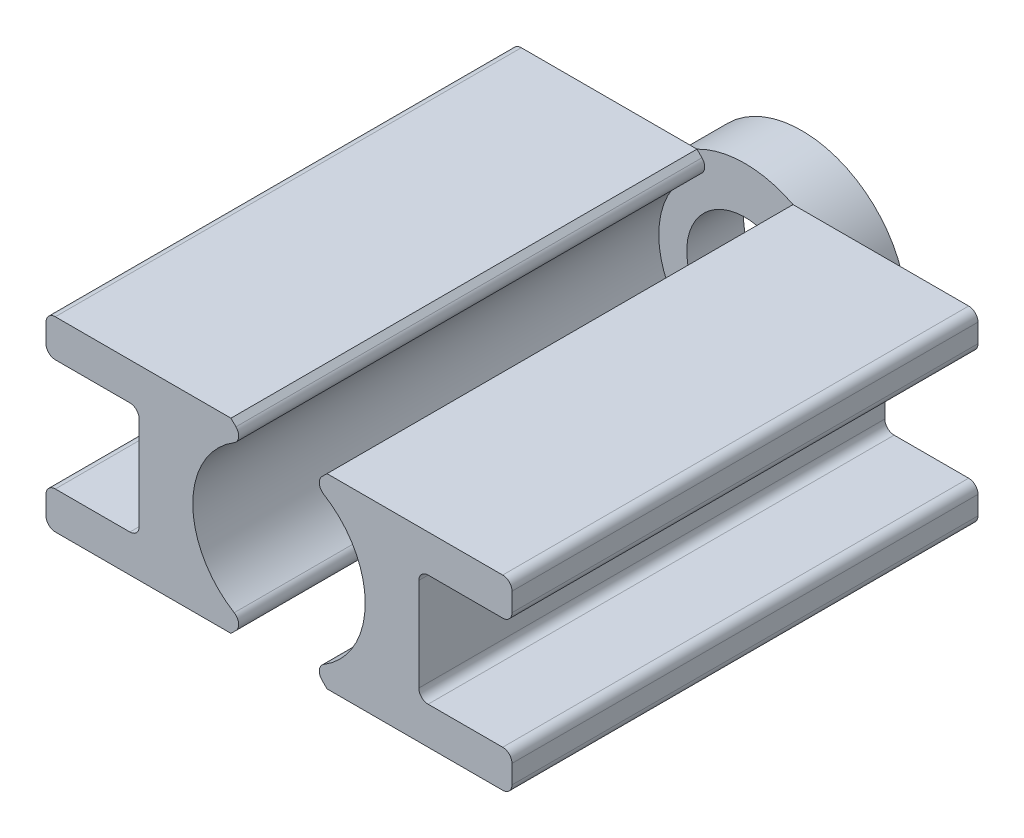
ISO-10303-21;
HEADER;
FILE_DESCRIPTION(('STEP AP214'),'2;1');
FILE_NAME('part.step','',(''),(''),'','','');
FILE_SCHEMA(('AUTOMOTIVE_DESIGN { 1 0 10303 214 1 1 1 1 }'));
ENDSEC;
DATA;
#1=APPLICATION_CONTEXT('core data for automotive mechanical design processes');
#2=APPLICATION_PROTOCOL_DEFINITION('international standard','automotive_design',2000,#1);
#3=PRODUCT_CONTEXT('',#1,'mechanical');
#4=PRODUCT('Part','Part','',(#3));
#5=PRODUCT_RELATED_PRODUCT_CATEGORY('part','',(#4));
#6=PRODUCT_DEFINITION_FORMATION('','',#4);
#7=PRODUCT_DEFINITION_CONTEXT('part definition',#1,'design');
#8=PRODUCT_DEFINITION('design','',#6,#7);
#9=PRODUCT_DEFINITION_SHAPE('','',#8);
#10=(LENGTH_UNIT() NAMED_UNIT(*) SI_UNIT(.MILLI.,.METRE.));
#11=(NAMED_UNIT(*) PLANE_ANGLE_UNIT() SI_UNIT($,.RADIAN.));
#12=(NAMED_UNIT(*) SI_UNIT($,.STERADIAN.) SOLID_ANGLE_UNIT());
#13=UNCERTAINTY_MEASURE_WITH_UNIT(LENGTH_MEASURE(1.E-05),#10,'distance_accuracy_value','');
#14=(GEOMETRIC_REPRESENTATION_CONTEXT(3) GLOBAL_UNCERTAINTY_ASSIGNED_CONTEXT((#13)) GLOBAL_UNIT_ASSIGNED_CONTEXT((#10,
#11,#12)) REPRESENTATION_CONTEXT('',''));
#15=CARTESIAN_POINT('',(0.,0.,0.));
#16=DIRECTION('',(0.,0.,1.));
#17=DIRECTION('',(1.,0.,0.));
#18=AXIS2_PLACEMENT_3D('',#15,#16,#17);
#19=CARTESIAN_POINT('',(0.,0.,12.2));
#20=DIRECTION('',(0.,0.,1.));
#21=DIRECTION('',(1.,0.,0.));
#22=AXIS2_PLACEMENT_3D('',#19,#20,#21);
#23=PLANE('',#22);
#24=CARTESIAN_POINT('',(0.,0.,12.2));
#25=DIRECTION('',(0.,0.,1.));
#26=DIRECTION('',(1.,0.,0.));
#27=AXIS2_PLACEMENT_3D('',#24,#25,#26);
#28=CIRCLE('',#27,22.5);
#29=CARTESIAN_POINT('',(10.307764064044,20.0000000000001,12.2));
#30=VERTEX_POINT('',#29);
#31=CARTESIAN_POINT('',(-10.3077640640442,20.,12.2));
#32=VERTEX_POINT('',#31);
#33=EDGE_CURVE('E11',#30,#32,#28,.T.);
#34=ORIENTED_EDGE('',*,*,#33,.T.);
#35=DIRECTION('',(-0.707106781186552,0.707106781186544,0.));
#36=VECTOR('',#35,1.);
#37=CARTESIAN_POINT('',(-10.3077640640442,20.,12.2));
#38=LINE('',#37,#36);
#39=CARTESIAN_POINT('',(-9.23745516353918,18.929691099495,12.2));
#40=VERTEX_POINT('',#39);
#41=EDGE_CURVE('E295',#40,#32,#38,.T.);
#42=ORIENTED_EDGE('',*,*,#41,.F.);
#43=CARTESIAN_POINT('',(-10.6516687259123,17.5154775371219,12.2));
#44=DIRECTION('',(0.,0.,1.));
#45=DIRECTION('',(1.,0.,0.));
#46=AXIS2_PLACEMENT_3D('',#43,#44,#45);
#47=CIRCLE('',#46,2.);
#48=CARTESIAN_POINT('',(-9.61248153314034,15.8066504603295,12.2));
#49=VERTEX_POINT('',#48);
#50=EDGE_CURVE('E292',#49,#40,#47,.T.);
#51=ORIENTED_EDGE('',*,*,#50,.F.);
#52=CARTESIAN_POINT('',(0.,0.,12.2));
#53=DIRECTION('',(0.,0.,-1.));
#54=DIRECTION('',(1.,0.,0.));
#55=AXIS2_PLACEMENT_3D('',#52,#53,#54);
#56=CIRCLE('',#55,18.5);
#57=CARTESIAN_POINT('',(-9.61248153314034,-15.8066504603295,12.2));
#58=VERTEX_POINT('',#57);
#59=EDGE_CURVE('E60',#58,#49,#56,.T.);
#60=ORIENTED_EDGE('',*,*,#59,.F.);
#61=CARTESIAN_POINT('',(-10.6516687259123,-17.5154775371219,12.2));
#62=DIRECTION('',(0.,0.,1.));
#63=DIRECTION('',(1.,0.,0.));
#64=AXIS2_PLACEMENT_3D('',#61,#62,#63);
#65=CIRCLE('',#64,2.);
#66=CARTESIAN_POINT('',(-9.23745516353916,-18.929691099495,12.2));
#67=VERTEX_POINT('',#66);
#68=EDGE_CURVE('E55',#67,#58,#65,.T.);
#69=ORIENTED_EDGE('',*,*,#68,.F.);
#70=DIRECTION('',(0.707106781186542,0.707106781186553,0.));
#71=VECTOR('',#70,1.);
#72=CARTESIAN_POINT('',(-10.3077640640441,-20.,12.2));
#73=LINE('',#72,#71);
#74=CARTESIAN_POINT('',(-10.3077640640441,-20.,12.2));
#75=VERTEX_POINT('',#74);
#76=EDGE_CURVE('E508',#75,#67,#73,.T.);
#77=ORIENTED_EDGE('',*,*,#76,.F.);
#78=CARTESIAN_POINT('',(10.3077640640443,-19.9999999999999,12.2));
#79=VERTEX_POINT('',#78);
#80=EDGE_CURVE('E47',#75,#79,#28,.T.);
#81=ORIENTED_EDGE('',*,*,#80,.T.);
#82=DIRECTION('',(0.70710678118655,-0.707106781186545,0.));
#83=VECTOR('',#82,1.);
#84=CARTESIAN_POINT('',(10.3077640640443,-19.9999999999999,12.2));
#85=LINE('',#84,#83);
#86=CARTESIAN_POINT('',(9.23745516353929,-18.9296910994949,12.2));
#87=VERTEX_POINT('',#86);
#88=EDGE_CURVE('E358',#87,#79,#85,.T.);
#89=ORIENTED_EDGE('',*,*,#88,.F.);
#90=CARTESIAN_POINT('',(10.6516687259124,-17.5154775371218,12.2));
#91=DIRECTION('',(0.,0.,1.));
#92=DIRECTION('',(1.,0.,0.));
#93=AXIS2_PLACEMENT_3D('',#90,#91,#92);
#94=CIRCLE('',#93,2.);
#95=CARTESIAN_POINT('',(9.61248153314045,-15.8066504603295,12.2));
#96=VERTEX_POINT('',#95);
#97=EDGE_CURVE('E355',#96,#87,#94,.T.);
#98=ORIENTED_EDGE('',*,*,#97,.F.);
#99=CARTESIAN_POINT('',(0.,0.,12.2));
#100=DIRECTION('',(0.,0.,-1.));
#101=DIRECTION('',(1.,0.,0.));
#102=AXIS2_PLACEMENT_3D('',#99,#100,#101);
#103=CIRCLE('',#102,18.5);
#104=CARTESIAN_POINT('',(9.61248153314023,15.8066504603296,12.2));
#105=VERTEX_POINT('',#104);
#106=EDGE_CURVE('E352',#105,#96,#103,.T.);
#107=ORIENTED_EDGE('',*,*,#106,.F.);
#108=CARTESIAN_POINT('',(10.6516687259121,17.515477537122,12.2));
#109=DIRECTION('',(0.,0.,1.));
#110=DIRECTION('',(1.,0.,0.));
#111=AXIS2_PLACEMENT_3D('',#108,#109,#110);
#112=CIRCLE('',#111,2.);
#113=CARTESIAN_POINT('',(9.23745516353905,18.9296910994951,12.2));
#114=VERTEX_POINT('',#113);
#115=EDGE_CURVE('E349',#114,#105,#112,.T.);
#116=ORIENTED_EDGE('',*,*,#115,.F.);
#117=DIRECTION('',(-0.707106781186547,-0.707106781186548,0.));
#118=VECTOR('',#117,1.);
#119=CARTESIAN_POINT('',(10.307764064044,20.0000000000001,12.2));
#120=LINE('',#119,#118);
#121=EDGE_CURVE('E346',#30,#114,#120,.T.);
#122=ORIENTED_EDGE('',*,*,#121,.F.);
#123=EDGE_LOOP('',(#34,#42,#51,#60,#69,#77,#81,#89,#98,#107,#116,#122));
#124=FACE_BOUND('',#123,.T.);
#125=CARTESIAN_POINT('',(0.,0.,12.2));
#126=DIRECTION('',(0.,0.,1.));
#127=DIRECTION('',(1.,0.,0.));
#128=AXIS2_PLACEMENT_3D('',#125,#126,#127);
#129=CIRCLE('',#128,12.5);
#130=CARTESIAN_POINT('',(12.5,0.,12.2));
#131=VERTEX_POINT('',#130);
#132=EDGE_CURVE('E436',#131,#131,#129,.T.);
#133=ORIENTED_EDGE('',*,*,#132,.F.);
#134=EDGE_LOOP('',(#133));
#135=FACE_BOUND('',#134,.T.);
#136=ADVANCED_FACE('F37',(#124,#135),#23,.T.);
#137=CARTESIAN_POINT('',(0.,0.,0.));
#138=DIRECTION('',(0.,0.,1.));
#139=DIRECTION('',(1.,0.,0.));
#140=AXIS2_PLACEMENT_3D('',#137,#138,#139);
#141=PLANE('',#140);
#142=CARTESIAN_POINT('',(0.,0.,0.));
#143=DIRECTION('',(0.,0.,1.));
#144=DIRECTION('',(1.,0.,0.));
#145=AXIS2_PLACEMENT_3D('',#142,#143,#144);
#146=CIRCLE('',#145,22.5);
#147=CARTESIAN_POINT('',(22.5,0.,0.));
#148=VERTEX_POINT('',#147);
#149=EDGE_CURVE('E41',#148,#148,#146,.T.);
#150=ORIENTED_EDGE('',*,*,#149,.F.);
#151=EDGE_LOOP('',(#150));
#152=FACE_BOUND('',#151,.T.);
#153=CARTESIAN_POINT('',(0.,0.,0.));
#154=DIRECTION('',(0.,0.,1.));
#155=DIRECTION('',(1.,0.,0.));
#156=AXIS2_PLACEMENT_3D('',#153,#154,#155);
#157=CIRCLE('',#156,12.5);
#158=CARTESIAN_POINT('',(12.5,0.,0.));
#159=VERTEX_POINT('',#158);
#160=EDGE_CURVE('E435',#159,#159,#157,.T.);
#161=ORIENTED_EDGE('',*,*,#160,.T.);
#162=EDGE_LOOP('',(#161));
#163=FACE_BOUND('',#162,.T.);
#164=ADVANCED_FACE('F442',(#152,#163),#141,.F.);
#165=CARTESIAN_POINT('',(0.,0.,12.2));
#166=DIRECTION('',(0.,0.,-1.));
#167=DIRECTION('',(-1.,0.,0.));
#168=AXIS2_PLACEMENT_3D('',#165,#166,#167);
#169=CYLINDRICAL_SURFACE('',#168,22.5);
#170=ORIENTED_EDGE('',*,*,#33,.F.);
#171=EDGE_CURVE('E48',#79,#30,#28,.T.);
#172=ORIENTED_EDGE('',*,*,#171,.F.);
#173=ORIENTED_EDGE('',*,*,#80,.F.);
#174=EDGE_CURVE('E46',#32,#75,#28,.T.);
#175=ORIENTED_EDGE('',*,*,#174,.F.);
#176=EDGE_LOOP('',(#170,#172,#173,#175));
#177=FACE_BOUND('',#176,.T.);
#178=ORIENTED_EDGE('',*,*,#149,.T.);
#179=EDGE_LOOP('',(#178));
#180=FACE_BOUND('',#179,.T.);
#181=ADVANCED_FACE('F39',(#177,#180),#169,.T.);
#182=CARTESIAN_POINT('',(0.,0.,12.2));
#183=DIRECTION('',(0.,0.,-1.));
#184=DIRECTION('',(-1.,0.,0.));
#185=AXIS2_PLACEMENT_3D('',#182,#183,#184);
#186=CYLINDRICAL_SURFACE('',#185,12.5);
#187=ORIENTED_EDGE('',*,*,#132,.T.);
#188=EDGE_LOOP('',(#187));
#189=FACE_BOUND('',#188,.T.);
#190=ORIENTED_EDGE('',*,*,#160,.F.);
#191=EDGE_LOOP('',(#190));
#192=FACE_BOUND('',#191,.T.);
#193=ADVANCED_FACE('F444',(#189,#192),#186,.F.);
#194=CARTESIAN_POINT('',(47.9999999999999,18.0000000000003,12.2));
#195=DIRECTION('',(0.,0.,1.));
#196=DIRECTION('',(1.,0.,0.));
#197=AXIS2_PLACEMENT_3D('',#194,#195,#196);
#198=PLANE('',#197);
#199=DIRECTION('',(1.,0.,0.));
#200=VECTOR('',#199,1.);
#201=CARTESIAN_POINT('',(48.0000000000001,-19.9999999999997,12.2));
#202=LINE('',#201,#200);
#203=CARTESIAN_POINT('',(48.0000000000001,-19.9999999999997,12.2));
#204=VERTEX_POINT('',#203);
#205=EDGE_CURVE('E361',#79,#204,#202,.T.);
#206=ORIENTED_EDGE('',*,*,#205,.F.);
#207=ORIENTED_EDGE('',*,*,#171,.T.);
#208=DIRECTION('',(-1.,0.,0.));
#209=VECTOR('',#208,1.);
#210=CARTESIAN_POINT('',(47.9999999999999,20.0000000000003,12.2));
#211=LINE('',#210,#209);
#212=CARTESIAN_POINT('',(47.9999999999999,20.0000000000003,12.2));
#213=VERTEX_POINT('',#212);
#214=EDGE_CURVE('E299',#213,#30,#211,.T.);
#215=ORIENTED_EDGE('',*,*,#214,.F.);
#216=CARTESIAN_POINT('',(47.9999999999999,18.0000000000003,12.2));
#217=DIRECTION('',(0.,0.,1.));
#218=DIRECTION('',(1.,0.,0.));
#219=AXIS2_PLACEMENT_3D('',#216,#217,#218);
#220=CIRCLE('',#219,2.);
#221=CARTESIAN_POINT('',(49.9999999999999,18.0000000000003,12.2));
#222=VERTEX_POINT('',#221);
#223=EDGE_CURVE('E296',#222,#213,#220,.T.);
#224=ORIENTED_EDGE('',*,*,#223,.F.);
#225=DIRECTION('',(0.,1.,0.));
#226=VECTOR('',#225,1.);
#227=CARTESIAN_POINT('',(49.9999999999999,18.0000000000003,12.2));
#228=LINE('',#227,#226);
#229=CARTESIAN_POINT('',(49.9999999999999,14.0000000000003,12.2));
#230=VERTEX_POINT('',#229);
#231=EDGE_CURVE('E309',#230,#222,#228,.T.);
#232=ORIENTED_EDGE('',*,*,#231,.F.);
#233=CARTESIAN_POINT('',(47.9999999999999,14.0000000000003,12.2));
#234=DIRECTION('',(0.,0.,1.));
#235=DIRECTION('',(-1.,0.,0.));
#236=AXIS2_PLACEMENT_3D('',#233,#234,#235);
#237=CIRCLE('',#236,2.);
#238=CARTESIAN_POINT('',(47.9999999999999,12.0000000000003,12.2));
#239=VERTEX_POINT('',#238);
#240=EDGE_CURVE('E379',#239,#230,#237,.T.);
#241=ORIENTED_EDGE('',*,*,#240,.F.);
#242=DIRECTION('',(1.,0.,0.));
#243=VECTOR('',#242,1.);
#244=CARTESIAN_POINT('',(47.9999999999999,12.0000000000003,12.2));
#245=LINE('',#244,#243);
#246=CARTESIAN_POINT('',(31.9999999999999,12.0000000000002,12.2));
#247=VERTEX_POINT('',#246);
#248=EDGE_CURVE('E377',#247,#239,#245,.T.);
#249=ORIENTED_EDGE('',*,*,#248,.F.);
#250=CARTESIAN_POINT('',(31.9999999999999,10.0000000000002,12.2));
#251=DIRECTION('',(0.,0.,-1.));
#252=DIRECTION('',(1.,0.,0.));
#253=AXIS2_PLACEMENT_3D('',#250,#251,#252);
#254=CIRCLE('',#253,2.);
#255=CARTESIAN_POINT('',(29.9999999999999,10.0000000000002,12.2));
#256=VERTEX_POINT('',#255);
#257=EDGE_CURVE('E375',#256,#247,#254,.T.);
#258=ORIENTED_EDGE('',*,*,#257,.F.);
#259=DIRECTION('',(0.,1.,0.));
#260=VECTOR('',#259,1.);
#261=CARTESIAN_POINT('',(29.9999999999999,10.0000000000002,12.2));
#262=LINE('',#261,#260);
#263=CARTESIAN_POINT('',(30.0000000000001,-9.99999999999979,12.2));
#264=VERTEX_POINT('',#263);
#265=EDGE_CURVE('E373',#264,#256,#262,.T.);
#266=ORIENTED_EDGE('',*,*,#265,.F.);
#267=CARTESIAN_POINT('',(32.0000000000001,-9.99999999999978,12.2));
#268=DIRECTION('',(0.,0.,-1.));
#269=DIRECTION('',(1.,0.,0.));
#270=AXIS2_PLACEMENT_3D('',#267,#268,#269);
#271=CIRCLE('',#270,2.);
#272=CARTESIAN_POINT('',(32.0000000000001,-11.9999999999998,12.2));
#273=VERTEX_POINT('',#272);
#274=EDGE_CURVE('E371',#273,#264,#271,.T.);
#275=ORIENTED_EDGE('',*,*,#274,.F.);
#276=DIRECTION('',(-1.,0.,0.));
#277=VECTOR('',#276,1.);
#278=CARTESIAN_POINT('',(48.0000000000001,-11.9999999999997,12.2));
#279=LINE('',#278,#277);
#280=CARTESIAN_POINT('',(48.0000000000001,-11.9999999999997,12.2));
#281=VERTEX_POINT('',#280);
#282=EDGE_CURVE('E369',#281,#273,#279,.T.);
#283=ORIENTED_EDGE('',*,*,#282,.F.);
#284=CARTESIAN_POINT('',(48.0000000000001,-13.9999999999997,12.2));
#285=DIRECTION('',(0.,0.,1.));
#286=DIRECTION('',(1.,0.,0.));
#287=AXIS2_PLACEMENT_3D('',#284,#285,#286);
#288=CIRCLE('',#287,2.);
#289=CARTESIAN_POINT('',(50.0000000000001,-13.9999999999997,12.2));
#290=VERTEX_POINT('',#289);
#291=EDGE_CURVE('E367',#290,#281,#288,.T.);
#292=ORIENTED_EDGE('',*,*,#291,.F.);
#293=DIRECTION('',(0.,1.,0.));
#294=VECTOR('',#293,1.);
#295=CARTESIAN_POINT('',(50.0000000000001,-13.9999999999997,12.2));
#296=LINE('',#295,#294);
#297=CARTESIAN_POINT('',(50.0000000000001,-17.9999999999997,12.2));
#298=VERTEX_POINT('',#297);
#299=EDGE_CURVE('E365',#298,#290,#296,.T.);
#300=ORIENTED_EDGE('',*,*,#299,.F.);
#301=CARTESIAN_POINT('',(48.0000000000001,-17.9999999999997,12.2));
#302=DIRECTION('',(0.,0.,1.));
#303=DIRECTION('',(-1.,0.,0.));
#304=AXIS2_PLACEMENT_3D('',#301,#302,#303);
#305=CIRCLE('',#304,2.);
#306=EDGE_CURVE('E363',#204,#298,#305,.T.);
#307=ORIENTED_EDGE('',*,*,#306,.F.);
#308=EDGE_LOOP('',(#206,#207,#215,#224,#232,#241,#249,#258,#266,#275,#283,#292,#300,#307));
#309=FACE_BOUND('',#308,.T.);
#310=ADVANCED_FACE('F446',(#309),#198,.F.);
#311=CARTESIAN_POINT('',(47.9999999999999,18.0000000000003,112.2));
#312=DIRECTION('',(0.,0.,-1.));
#313=DIRECTION('',(-1.,0.,0.));
#314=AXIS2_PLACEMENT_3D('',#311,#312,#313);
#315=CYLINDRICAL_SURFACE('',#314,2.);
#316=ORIENTED_EDGE('',*,*,#223,.T.);
#317=DIRECTION('',(0.,0.,-1.));
#318=VECTOR('',#317,1.);
#319=CARTESIAN_POINT('',(47.9999999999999,20.0000000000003,112.2));
#320=LINE('',#319,#318);
#321=CARTESIAN_POINT('',(47.9999999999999,20.0000000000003,112.2));
#322=VERTEX_POINT('',#321);
#323=EDGE_CURVE('E432',#322,#213,#320,.T.);
#324=ORIENTED_EDGE('',*,*,#323,.F.);
#325=CARTESIAN_POINT('',(47.9999999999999,18.0000000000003,112.2));
#326=DIRECTION('',(0.,0.,1.));
#327=DIRECTION('',(1.,0.,0.));
#328=AXIS2_PLACEMENT_3D('',#325,#326,#327);
#329=CIRCLE('',#328,2.);
#330=CARTESIAN_POINT('',(49.9999999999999,18.0000000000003,112.2));
#331=VERTEX_POINT('',#330);
#332=EDGE_CURVE('E305',#331,#322,#329,.T.);
#333=ORIENTED_EDGE('',*,*,#332,.F.);
#334=DIRECTION('',(0.,0.,-1.));
#335=VECTOR('',#334,1.);
#336=CARTESIAN_POINT('',(49.9999999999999,18.0000000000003,112.2));
#337=LINE('',#336,#335);
#338=EDGE_CURVE('E342',#331,#222,#337,.T.);
#339=ORIENTED_EDGE('',*,*,#338,.T.);
#340=EDGE_LOOP('',(#316,#324,#333,#339));
#341=FACE_BOUND('',#340,.T.);
#342=ADVANCED_FACE('F453',(#341),#315,.T.);
#343=CARTESIAN_POINT('',(47.9999999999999,20.0000000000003,112.2));
#344=DIRECTION('',(0.,-1.,0.));
#345=DIRECTION('',(1.,0.,0.));
#346=AXIS2_PLACEMENT_3D('',#343,#344,#345);
#347=PLANE('',#346);
#348=ORIENTED_EDGE('',*,*,#214,.T.);
#349=DIRECTION('',(0.,0.,-1.));
#350=VECTOR('',#349,1.);
#351=CARTESIAN_POINT('',(10.307764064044,20.0000000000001,112.2));
#352=LINE('',#351,#350);
#353=CARTESIAN_POINT('',(10.307764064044,20.0000000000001,112.2));
#354=VERTEX_POINT('',#353);
#355=EDGE_CURVE('E429',#354,#30,#352,.T.);
#356=ORIENTED_EDGE('',*,*,#355,.F.);
#357=DIRECTION('',(-1.,0.,0.));
#358=VECTOR('',#357,1.);
#359=CARTESIAN_POINT('',(47.9999999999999,20.0000000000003,112.2));
#360=LINE('',#359,#358);
#361=EDGE_CURVE('E308',#322,#354,#360,.T.);
#362=ORIENTED_EDGE('',*,*,#361,.F.);
#363=ORIENTED_EDGE('',*,*,#323,.T.);
#364=EDGE_LOOP('',(#348,#356,#362,#363));
#365=FACE_BOUND('',#364,.T.);
#366=ADVANCED_FACE('F741',(#365),#347,.F.);
#367=CARTESIAN_POINT('',(10.307764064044,20.0000000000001,112.2));
#368=DIRECTION('',(0.707106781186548,-0.707106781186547,0.));
#369=DIRECTION('',(0.707106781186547,0.707106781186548,0.));
#370=AXIS2_PLACEMENT_3D('',#367,#368,#369);
#371=PLANE('',#370);
#372=ORIENTED_EDGE('',*,*,#121,.T.);
#373=DIRECTION('',(0.,0.,-1.));
#374=VECTOR('',#373,1.);
#375=CARTESIAN_POINT('',(9.23745516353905,18.9296910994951,112.2));
#376=LINE('',#375,#374);
#377=CARTESIAN_POINT('',(9.23745516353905,18.9296910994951,112.2));
#378=VERTEX_POINT('',#377);
#379=EDGE_CURVE('E426',#378,#114,#376,.T.);
#380=ORIENTED_EDGE('',*,*,#379,.F.);
#381=DIRECTION('',(-0.707106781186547,-0.707106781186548,0.));
#382=VECTOR('',#381,1.);
#383=CARTESIAN_POINT('',(10.307764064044,20.0000000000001,112.2));
#384=LINE('',#383,#382);
#385=EDGE_CURVE('E311',#354,#378,#384,.T.);
#386=ORIENTED_EDGE('',*,*,#385,.F.);
#387=ORIENTED_EDGE('',*,*,#355,.T.);
#388=EDGE_LOOP('',(#372,#380,#386,#387));
#389=FACE_BOUND('',#388,.T.);
#390=ADVANCED_FACE('F737',(#389),#371,.F.);
#391=CARTESIAN_POINT('',(10.6516687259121,17.515477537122,112.2));
#392=DIRECTION('',(0.,0.,-1.));
#393=DIRECTION('',(-1.,0.,0.));
#394=AXIS2_PLACEMENT_3D('',#391,#392,#393);
#395=CYLINDRICAL_SURFACE('',#394,2.);
#396=ORIENTED_EDGE('',*,*,#115,.T.);
#397=DIRECTION('',(0.,0.,-1.));
#398=VECTOR('',#397,1.);
#399=CARTESIAN_POINT('',(9.61248153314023,15.8066504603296,112.2));
#400=LINE('',#399,#398);
#401=CARTESIAN_POINT('',(9.61248153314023,15.8066504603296,112.2));
#402=VERTEX_POINT('',#401);
#403=EDGE_CURVE('E423',#402,#105,#400,.T.);
#404=ORIENTED_EDGE('',*,*,#403,.F.);
#405=CARTESIAN_POINT('',(10.6516687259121,17.515477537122,112.2));
#406=DIRECTION('',(0.,0.,1.));
#407=DIRECTION('',(1.,0.,0.));
#408=AXIS2_PLACEMENT_3D('',#405,#406,#407);
#409=CIRCLE('',#408,2.);
#410=EDGE_CURVE('E313',#378,#402,#409,.T.);
#411=ORIENTED_EDGE('',*,*,#410,.F.);
#412=ORIENTED_EDGE('',*,*,#379,.T.);
#413=EDGE_LOOP('',(#396,#404,#411,#412));
#414=FACE_BOUND('',#413,.T.);
#415=ADVANCED_FACE('F733',(#414),#395,.T.);
#416=CARTESIAN_POINT('',(0.,0.,112.2));
#417=DIRECTION('',(0.,0.,-1.));
#418=DIRECTION('',(-1.,0.,0.));
#419=AXIS2_PLACEMENT_3D('',#416,#417,#418);
#420=CYLINDRICAL_SURFACE('',#419,18.5);
#421=ORIENTED_EDGE('',*,*,#106,.T.);
#422=DIRECTION('',(0.,0.,-1.));
#423=VECTOR('',#422,1.);
#424=CARTESIAN_POINT('',(9.61248153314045,-15.8066504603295,112.2));
#425=LINE('',#424,#423);
#426=CARTESIAN_POINT('',(9.61248153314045,-15.8066504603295,112.2));
#427=VERTEX_POINT('',#426);
#428=EDGE_CURVE('E420',#427,#96,#425,.T.);
#429=ORIENTED_EDGE('',*,*,#428,.F.);
#430=CARTESIAN_POINT('',(0.,0.,112.2));
#431=DIRECTION('',(0.,0.,-1.));
#432=DIRECTION('',(1.,0.,0.));
#433=AXIS2_PLACEMENT_3D('',#430,#431,#432);
#434=CIRCLE('',#433,18.5);
#435=EDGE_CURVE('E315',#402,#427,#434,.T.);
#436=ORIENTED_EDGE('',*,*,#435,.F.);
#437=ORIENTED_EDGE('',*,*,#403,.T.);
#438=EDGE_LOOP('',(#421,#429,#436,#437));
#439=FACE_BOUND('',#438,.T.);
#440=ADVANCED_FACE('F729',(#439),#420,.F.);
#441=CARTESIAN_POINT('',(10.6516687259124,-17.5154775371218,112.2));
#442=DIRECTION('',(0.,0.,-1.));
#443=DIRECTION('',(-1.,0.,0.));
#444=AXIS2_PLACEMENT_3D('',#441,#442,#443);
#445=CYLINDRICAL_SURFACE('',#444,2.);
#446=ORIENTED_EDGE('',*,*,#97,.T.);
#447=DIRECTION('',(0.,0.,-1.));
#448=VECTOR('',#447,1.);
#449=CARTESIAN_POINT('',(9.23745516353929,-18.9296910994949,112.2));
#450=LINE('',#449,#448);
#451=CARTESIAN_POINT('',(9.23745516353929,-18.9296910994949,112.2));
#452=VERTEX_POINT('',#451);
#453=EDGE_CURVE('E417',#452,#87,#450,.T.);
#454=ORIENTED_EDGE('',*,*,#453,.F.);
#455=CARTESIAN_POINT('',(10.6516687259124,-17.5154775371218,112.2));
#456=DIRECTION('',(0.,0.,1.));
#457=DIRECTION('',(1.,0.,0.));
#458=AXIS2_PLACEMENT_3D('',#455,#456,#457);
#459=CIRCLE('',#458,2.);
#460=EDGE_CURVE('E317',#427,#452,#459,.T.);
#461=ORIENTED_EDGE('',*,*,#460,.F.);
#462=ORIENTED_EDGE('',*,*,#428,.T.);
#463=EDGE_LOOP('',(#446,#454,#461,#462));
#464=FACE_BOUND('',#463,.T.);
#465=ADVANCED_FACE('F725',(#464),#445,.T.);
#466=CARTESIAN_POINT('',(10.3077640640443,-19.9999999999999,112.2));
#467=DIRECTION('',(0.707106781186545,0.70710678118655,0.));
#468=DIRECTION('',(-0.70710678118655,0.707106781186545,0.));
#469=AXIS2_PLACEMENT_3D('',#466,#467,#468);
#470=PLANE('',#469);
#471=ORIENTED_EDGE('',*,*,#88,.T.);
#472=DIRECTION('',(0.,0.,-1.));
#473=VECTOR('',#472,1.);
#474=CARTESIAN_POINT('',(10.3077640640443,-19.9999999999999,112.2));
#475=LINE('',#474,#473);
#476=CARTESIAN_POINT('',(10.3077640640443,-19.9999999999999,112.2));
#477=VERTEX_POINT('',#476);
#478=EDGE_CURVE('E414',#477,#79,#475,.T.);
#479=ORIENTED_EDGE('',*,*,#478,.F.);
#480=DIRECTION('',(0.70710678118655,-0.707106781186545,0.));
#481=VECTOR('',#480,1.);
#482=CARTESIAN_POINT('',(10.3077640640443,-19.9999999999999,112.2));
#483=LINE('',#482,#481);
#484=EDGE_CURVE('E319',#452,#477,#483,.T.);
#485=ORIENTED_EDGE('',*,*,#484,.F.);
#486=ORIENTED_EDGE('',*,*,#453,.T.);
#487=EDGE_LOOP('',(#471,#479,#485,#486));
#488=FACE_BOUND('',#487,.T.);
#489=ADVANCED_FACE('F721',(#488),#470,.F.);
#490=CARTESIAN_POINT('',(48.0000000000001,-19.9999999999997,112.2));
#491=DIRECTION('',(0.,1.,0.));
#492=DIRECTION('',(-1.,0.,0.));
#493=AXIS2_PLACEMENT_3D('',#490,#491,#492);
#494=PLANE('',#493);
#495=ORIENTED_EDGE('',*,*,#205,.T.);
#496=DIRECTION('',(0.,0.,-1.));
#497=VECTOR('',#496,1.);
#498=CARTESIAN_POINT('',(48.0000000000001,-19.9999999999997,112.2));
#499=LINE('',#498,#497);
#500=CARTESIAN_POINT('',(48.0000000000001,-19.9999999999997,112.2));
#501=VERTEX_POINT('',#500);
#502=EDGE_CURVE('E411',#501,#204,#499,.T.);
#503=ORIENTED_EDGE('',*,*,#502,.F.);
#504=DIRECTION('',(1.,0.,0.));
#505=VECTOR('',#504,1.);
#506=CARTESIAN_POINT('',(48.0000000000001,-19.9999999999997,112.2));
#507=LINE('',#506,#505);
#508=EDGE_CURVE('E321',#477,#501,#507,.T.);
#509=ORIENTED_EDGE('',*,*,#508,.F.);
#510=ORIENTED_EDGE('',*,*,#478,.T.);
#511=EDGE_LOOP('',(#495,#503,#509,#510));
#512=FACE_BOUND('',#511,.T.);
#513=ADVANCED_FACE('F717',(#512),#494,.F.);
#514=CARTESIAN_POINT('',(48.0000000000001,-17.9999999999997,112.2));
#515=DIRECTION('',(0.,0.,-1.));
#516=DIRECTION('',(-1.,0.,0.));
#517=AXIS2_PLACEMENT_3D('',#514,#515,#516);
#518=CYLINDRICAL_SURFACE('',#517,2.);
#519=ORIENTED_EDGE('',*,*,#306,.T.);
#520=DIRECTION('',(0.,0.,-1.));
#521=VECTOR('',#520,1.);
#522=CARTESIAN_POINT('',(50.0000000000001,-17.9999999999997,112.2));
#523=LINE('',#522,#521);
#524=CARTESIAN_POINT('',(50.0000000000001,-17.9999999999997,112.2));
#525=VERTEX_POINT('',#524);
#526=EDGE_CURVE('E408',#525,#298,#523,.T.);
#527=ORIENTED_EDGE('',*,*,#526,.F.);
#528=CARTESIAN_POINT('',(48.0000000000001,-17.9999999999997,112.2));
#529=DIRECTION('',(0.,0.,1.));
#530=DIRECTION('',(-1.,0.,0.));
#531=AXIS2_PLACEMENT_3D('',#528,#529,#530);
#532=CIRCLE('',#531,2.);
#533=EDGE_CURVE('E323',#501,#525,#532,.T.);
#534=ORIENTED_EDGE('',*,*,#533,.F.);
#535=ORIENTED_EDGE('',*,*,#502,.T.);
#536=EDGE_LOOP('',(#519,#527,#534,#535));
#537=FACE_BOUND('',#536,.T.);
#538=ADVANCED_FACE('F713',(#537),#518,.T.);
#539=CARTESIAN_POINT('',(50.0000000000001,-13.9999999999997,112.2));
#540=DIRECTION('',(-1.,0.,0.));
#541=DIRECTION('',(0.,-1.,0.));
#542=AXIS2_PLACEMENT_3D('',#539,#540,#541);
#543=PLANE('',#542);
#544=ORIENTED_EDGE('',*,*,#299,.T.);
#545=DIRECTION('',(0.,0.,-1.));
#546=VECTOR('',#545,1.);
#547=CARTESIAN_POINT('',(50.0000000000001,-13.9999999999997,112.2));
#548=LINE('',#547,#546);
#549=CARTESIAN_POINT('',(50.0000000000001,-13.9999999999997,112.2));
#550=VERTEX_POINT('',#549);
#551=EDGE_CURVE('E405',#550,#290,#548,.T.);
#552=ORIENTED_EDGE('',*,*,#551,.F.);
#553=DIRECTION('',(0.,1.,0.));
#554=VECTOR('',#553,1.);
#555=CARTESIAN_POINT('',(50.0000000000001,-13.9999999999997,112.2));
#556=LINE('',#555,#554);
#557=EDGE_CURVE('E325',#525,#550,#556,.T.);
#558=ORIENTED_EDGE('',*,*,#557,.F.);
#559=ORIENTED_EDGE('',*,*,#526,.T.);
#560=EDGE_LOOP('',(#544,#552,#558,#559));
#561=FACE_BOUND('',#560,.T.);
#562=ADVANCED_FACE('F709',(#561),#543,.F.);
#563=CARTESIAN_POINT('',(48.0000000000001,-13.9999999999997,112.2));
#564=DIRECTION('',(0.,0.,-1.));
#565=DIRECTION('',(-1.,0.,0.));
#566=AXIS2_PLACEMENT_3D('',#563,#564,#565);
#567=CYLINDRICAL_SURFACE('',#566,2.);
#568=ORIENTED_EDGE('',*,*,#291,.T.);
#569=DIRECTION('',(0.,0.,-1.));
#570=VECTOR('',#569,1.);
#571=CARTESIAN_POINT('',(48.0000000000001,-11.9999999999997,112.2));
#572=LINE('',#571,#570);
#573=CARTESIAN_POINT('',(48.0000000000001,-11.9999999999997,112.2));
#574=VERTEX_POINT('',#573);
#575=EDGE_CURVE('E402',#574,#281,#572,.T.);
#576=ORIENTED_EDGE('',*,*,#575,.F.);
#577=CARTESIAN_POINT('',(48.0000000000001,-13.9999999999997,112.2));
#578=DIRECTION('',(0.,0.,1.));
#579=DIRECTION('',(1.,0.,0.));
#580=AXIS2_PLACEMENT_3D('',#577,#578,#579);
#581=CIRCLE('',#580,2.);
#582=EDGE_CURVE('E327',#550,#574,#581,.T.);
#583=ORIENTED_EDGE('',*,*,#582,.F.);
#584=ORIENTED_EDGE('',*,*,#551,.T.);
#585=EDGE_LOOP('',(#568,#576,#583,#584));
#586=FACE_BOUND('',#585,.T.);
#587=ADVANCED_FACE('F705',(#586),#567,.T.);
#588=CARTESIAN_POINT('',(48.0000000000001,-11.9999999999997,112.2));
#589=DIRECTION('',(0.,-1.,0.));
#590=DIRECTION('',(1.,0.,0.));
#591=AXIS2_PLACEMENT_3D('',#588,#589,#590);
#592=PLANE('',#591);
#593=ORIENTED_EDGE('',*,*,#282,.T.);
#594=DIRECTION('',(0.,0.,-1.));
#595=VECTOR('',#594,1.);
#596=CARTESIAN_POINT('',(32.0000000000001,-11.9999999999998,112.2));
#597=LINE('',#596,#595);
#598=CARTESIAN_POINT('',(32.0000000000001,-11.9999999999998,112.2));
#599=VERTEX_POINT('',#598);
#600=EDGE_CURVE('E399',#599,#273,#597,.T.);
#601=ORIENTED_EDGE('',*,*,#600,.F.);
#602=DIRECTION('',(-1.,0.,0.));
#603=VECTOR('',#602,1.);
#604=CARTESIAN_POINT('',(48.0000000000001,-11.9999999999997,112.2));
#605=LINE('',#604,#603);
#606=EDGE_CURVE('E329',#574,#599,#605,.T.);
#607=ORIENTED_EDGE('',*,*,#606,.F.);
#608=ORIENTED_EDGE('',*,*,#575,.T.);
#609=EDGE_LOOP('',(#593,#601,#607,#608));
#610=FACE_BOUND('',#609,.T.);
#611=ADVANCED_FACE('F701',(#610),#592,.F.);
#612=CARTESIAN_POINT('',(32.0000000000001,-9.99999999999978,112.2));
#613=DIRECTION('',(0.,0.,-1.));
#614=DIRECTION('',(-1.,0.,0.));
#615=AXIS2_PLACEMENT_3D('',#612,#613,#614);
#616=CYLINDRICAL_SURFACE('',#615,2.);
#617=ORIENTED_EDGE('',*,*,#274,.T.);
#618=DIRECTION('',(0.,0.,-1.));
#619=VECTOR('',#618,1.);
#620=CARTESIAN_POINT('',(30.0000000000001,-9.99999999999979,112.2));
#621=LINE('',#620,#619);
#622=CARTESIAN_POINT('',(30.0000000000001,-9.99999999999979,112.2));
#623=VERTEX_POINT('',#622);
#624=EDGE_CURVE('E396',#623,#264,#621,.T.);
#625=ORIENTED_EDGE('',*,*,#624,.F.);
#626=CARTESIAN_POINT('',(32.0000000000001,-9.99999999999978,112.2));
#627=DIRECTION('',(0.,0.,-1.));
#628=DIRECTION('',(1.,0.,0.));
#629=AXIS2_PLACEMENT_3D('',#626,#627,#628);
#630=CIRCLE('',#629,2.);
#631=EDGE_CURVE('E331',#599,#623,#630,.T.);
#632=ORIENTED_EDGE('',*,*,#631,.F.);
#633=ORIENTED_EDGE('',*,*,#600,.T.);
#634=EDGE_LOOP('',(#617,#625,#632,#633));
#635=FACE_BOUND('',#634,.T.);
#636=ADVANCED_FACE('F697',(#635),#616,.F.);
#637=CARTESIAN_POINT('',(29.9999999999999,10.0000000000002,112.2));
#638=DIRECTION('',(-1.,0.,0.));
#639=DIRECTION('',(0.,-1.,0.));
#640=AXIS2_PLACEMENT_3D('',#637,#638,#639);
#641=PLANE('',#640);
#642=ORIENTED_EDGE('',*,*,#265,.T.);
#643=DIRECTION('',(0.,0.,-1.));
#644=VECTOR('',#643,1.);
#645=CARTESIAN_POINT('',(29.9999999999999,10.0000000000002,112.2));
#646=LINE('',#645,#644);
#647=CARTESIAN_POINT('',(29.9999999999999,10.0000000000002,112.2));
#648=VERTEX_POINT('',#647);
#649=EDGE_CURVE('E393',#648,#256,#646,.T.);
#650=ORIENTED_EDGE('',*,*,#649,.F.);
#651=DIRECTION('',(0.,1.,0.));
#652=VECTOR('',#651,1.);
#653=CARTESIAN_POINT('',(29.9999999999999,10.0000000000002,112.2));
#654=LINE('',#653,#652);
#655=EDGE_CURVE('E333',#623,#648,#654,.T.);
#656=ORIENTED_EDGE('',*,*,#655,.F.);
#657=ORIENTED_EDGE('',*,*,#624,.T.);
#658=EDGE_LOOP('',(#642,#650,#656,#657));
#659=FACE_BOUND('',#658,.T.);
#660=ADVANCED_FACE('F693',(#659),#641,.F.);
#661=CARTESIAN_POINT('',(31.9999999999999,10.0000000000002,112.2));
#662=DIRECTION('',(0.,0.,-1.));
#663=DIRECTION('',(-1.,0.,0.));
#664=AXIS2_PLACEMENT_3D('',#661,#662,#663);
#665=CYLINDRICAL_SURFACE('',#664,2.);
#666=ORIENTED_EDGE('',*,*,#257,.T.);
#667=DIRECTION('',(0.,0.,-1.));
#668=VECTOR('',#667,1.);
#669=CARTESIAN_POINT('',(31.9999999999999,12.0000000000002,112.2));
#670=LINE('',#669,#668);
#671=CARTESIAN_POINT('',(31.9999999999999,12.0000000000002,112.2));
#672=VERTEX_POINT('',#671);
#673=EDGE_CURVE('E390',#672,#247,#670,.T.);
#674=ORIENTED_EDGE('',*,*,#673,.F.);
#675=CARTESIAN_POINT('',(31.9999999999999,10.0000000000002,112.2));
#676=DIRECTION('',(0.,0.,-1.));
#677=DIRECTION('',(1.,0.,0.));
#678=AXIS2_PLACEMENT_3D('',#675,#676,#677);
#679=CIRCLE('',#678,2.);
#680=EDGE_CURVE('E335',#648,#672,#679,.T.);
#681=ORIENTED_EDGE('',*,*,#680,.F.);
#682=ORIENTED_EDGE('',*,*,#649,.T.);
#683=EDGE_LOOP('',(#666,#674,#681,#682));
#684=FACE_BOUND('',#683,.T.);
#685=ADVANCED_FACE('F689',(#684),#665,.F.);
#686=CARTESIAN_POINT('',(47.9999999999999,12.0000000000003,112.2));
#687=DIRECTION('',(0.,1.,0.));
#688=DIRECTION('',(-1.,0.,0.));
#689=AXIS2_PLACEMENT_3D('',#686,#687,#688);
#690=PLANE('',#689);
#691=ORIENTED_EDGE('',*,*,#248,.T.);
#692=DIRECTION('',(0.,0.,-1.));
#693=VECTOR('',#692,1.);
#694=CARTESIAN_POINT('',(47.9999999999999,12.0000000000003,112.2));
#695=LINE('',#694,#693);
#696=CARTESIAN_POINT('',(47.9999999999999,12.0000000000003,112.2));
#697=VERTEX_POINT('',#696);
#698=EDGE_CURVE('E387',#697,#239,#695,.T.);
#699=ORIENTED_EDGE('',*,*,#698,.F.);
#700=DIRECTION('',(1.,0.,0.));
#701=VECTOR('',#700,1.);
#702=CARTESIAN_POINT('',(47.9999999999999,12.0000000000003,112.2));
#703=LINE('',#702,#701);
#704=EDGE_CURVE('E337',#672,#697,#703,.T.);
#705=ORIENTED_EDGE('',*,*,#704,.F.);
#706=ORIENTED_EDGE('',*,*,#673,.T.);
#707=EDGE_LOOP('',(#691,#699,#705,#706));
#708=FACE_BOUND('',#707,.T.);
#709=ADVANCED_FACE('F685',(#708),#690,.F.);
#710=CARTESIAN_POINT('',(47.9999999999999,14.0000000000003,112.2));
#711=DIRECTION('',(0.,0.,-1.));
#712=DIRECTION('',(-1.,0.,0.));
#713=AXIS2_PLACEMENT_3D('',#710,#711,#712);
#714=CYLINDRICAL_SURFACE('',#713,2.);
#715=ORIENTED_EDGE('',*,*,#240,.T.);
#716=DIRECTION('',(0.,0.,-1.));
#717=VECTOR('',#716,1.);
#718=CARTESIAN_POINT('',(49.9999999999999,14.0000000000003,112.2));
#719=LINE('',#718,#717);
#720=CARTESIAN_POINT('',(49.9999999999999,14.0000000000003,112.2));
#721=VERTEX_POINT('',#720);
#722=EDGE_CURVE('E384',#721,#230,#719,.T.);
#723=ORIENTED_EDGE('',*,*,#722,.F.);
#724=CARTESIAN_POINT('',(47.9999999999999,14.0000000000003,112.2));
#725=DIRECTION('',(0.,0.,1.));
#726=DIRECTION('',(-1.,0.,0.));
#727=AXIS2_PLACEMENT_3D('',#724,#725,#726);
#728=CIRCLE('',#727,2.);
#729=EDGE_CURVE('E339',#697,#721,#728,.T.);
#730=ORIENTED_EDGE('',*,*,#729,.F.);
#731=ORIENTED_EDGE('',*,*,#698,.T.);
#732=EDGE_LOOP('',(#715,#723,#730,#731));
#733=FACE_BOUND('',#732,.T.);
#734=ADVANCED_FACE('F681',(#733),#714,.T.);
#735=CARTESIAN_POINT('',(49.9999999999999,18.0000000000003,112.2));
#736=DIRECTION('',(-1.,0.,0.));
#737=DIRECTION('',(0.,-1.,0.));
#738=AXIS2_PLACEMENT_3D('',#735,#736,#737);
#739=PLANE('',#738);
#740=ORIENTED_EDGE('',*,*,#231,.T.);
#741=ORIENTED_EDGE('',*,*,#338,.F.);
#742=DIRECTION('',(0.,1.,0.));
#743=VECTOR('',#742,1.);
#744=CARTESIAN_POINT('',(49.9999999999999,18.0000000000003,112.2));
#745=LINE('',#744,#743);
#746=EDGE_CURVE('E341',#721,#331,#745,.T.);
#747=ORIENTED_EDGE('',*,*,#746,.F.);
#748=ORIENTED_EDGE('',*,*,#722,.T.);
#749=EDGE_LOOP('',(#740,#741,#747,#748));
#750=FACE_BOUND('',#749,.T.);
#751=ADVANCED_FACE('F676',(#750),#739,.F.);
#752=CARTESIAN_POINT('',(47.9999999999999,18.0000000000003,112.2));
#753=DIRECTION('',(0.,0.,1.));
#754=DIRECTION('',(1.,0.,0.));
#755=AXIS2_PLACEMENT_3D('',#752,#753,#754);
#756=PLANE('',#755);
#757=ORIENTED_EDGE('',*,*,#332,.T.);
#758=ORIENTED_EDGE('',*,*,#361,.T.);
#759=ORIENTED_EDGE('',*,*,#385,.T.);
#760=ORIENTED_EDGE('',*,*,#410,.T.);
#761=ORIENTED_EDGE('',*,*,#435,.T.);
#762=ORIENTED_EDGE('',*,*,#460,.T.);
#763=ORIENTED_EDGE('',*,*,#484,.T.);
#764=ORIENTED_EDGE('',*,*,#508,.T.);
#765=ORIENTED_EDGE('',*,*,#533,.T.);
#766=ORIENTED_EDGE('',*,*,#557,.T.);
#767=ORIENTED_EDGE('',*,*,#582,.T.);
#768=ORIENTED_EDGE('',*,*,#606,.T.);
#769=ORIENTED_EDGE('',*,*,#631,.T.);
#770=ORIENTED_EDGE('',*,*,#655,.T.);
#771=ORIENTED_EDGE('',*,*,#680,.T.);
#772=ORIENTED_EDGE('',*,*,#704,.T.);
#773=ORIENTED_EDGE('',*,*,#729,.T.);
#774=ORIENTED_EDGE('',*,*,#746,.T.);
#775=EDGE_LOOP('',(#757,#758,#759,#760,#761,#762,#763,#764,#765,#766,#767,#768,#769,#770,#771,
#772,#773,#774));
#776=FACE_BOUND('',#775,.T.);
#777=ADVANCED_FACE('F674',(#776),#756,.T.);
#778=CARTESIAN_POINT('',(-10.3077640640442,20.,112.2));
#779=DIRECTION('',(-0.707106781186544,-0.707106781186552,0.));
#780=DIRECTION('',(0.707106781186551,-0.707106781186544,0.));
#781=AXIS2_PLACEMENT_3D('',#778,#779,#780);
#782=PLANE('',#781);
#783=ORIENTED_EDGE('',*,*,#41,.T.);
#784=DIRECTION('',(0.,0.,-1.));
#785=VECTOR('',#784,1.);
#786=CARTESIAN_POINT('',(-10.3077640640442,20.,112.2));
#787=LINE('',#786,#785);
#788=CARTESIAN_POINT('',(-10.3077640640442,20.,112.2));
#789=VERTEX_POINT('',#788);
#790=EDGE_CURVE('E276',#789,#32,#787,.T.);
#791=ORIENTED_EDGE('',*,*,#790,.F.);
#792=DIRECTION('',(-0.707106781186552,0.707106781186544,0.));
#793=VECTOR('',#792,1.);
#794=CARTESIAN_POINT('',(-10.3077640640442,20.,112.2));
#795=LINE('',#794,#793);
#796=CARTESIAN_POINT('',(-9.23745516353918,18.929691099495,112.2));
#797=VERTEX_POINT('',#796);
#798=EDGE_CURVE('E283',#797,#789,#795,.T.);
#799=ORIENTED_EDGE('',*,*,#798,.F.);
#800=DIRECTION('',(0.,0.,-1.));
#801=VECTOR('',#800,1.);
#802=CARTESIAN_POINT('',(-9.23745516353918,18.929691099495,112.2));
#803=LINE('',#802,#801);
#804=EDGE_CURVE('E513',#797,#40,#803,.T.);
#805=ORIENTED_EDGE('',*,*,#804,.T.);
#806=EDGE_LOOP('',(#783,#791,#799,#805));
#807=FACE_BOUND('',#806,.T.);
#808=ADVANCED_FACE('F294',(#807),#782,.F.);
#809=CARTESIAN_POINT('',(-48.,20.,112.2));
#810=DIRECTION('',(0.,-1.,0.));
#811=DIRECTION('',(0.,0.,-1.));
#812=AXIS2_PLACEMENT_3D('',#809,#810,#811);
#813=PLANE('',#812);
#814=DIRECTION('',(-1.,0.,0.));
#815=VECTOR('',#814,1.);
#816=CARTESIAN_POINT('',(-48.,20.,12.2));
#817=LINE('',#816,#815);
#818=CARTESIAN_POINT('',(-48.,20.,12.2));
#819=VERTEX_POINT('',#818);
#820=EDGE_CURVE('E475',#32,#819,#817,.T.);
#821=ORIENTED_EDGE('',*,*,#820,.T.);
#822=DIRECTION('',(0.,0.,-1.));
#823=VECTOR('',#822,1.);
#824=CARTESIAN_POINT('',(-48.,20.,112.2));
#825=LINE('',#824,#823);
#826=CARTESIAN_POINT('',(-48.,20.,112.2));
#827=VERTEX_POINT('',#826);
#828=EDGE_CURVE('E279',#827,#819,#825,.T.);
#829=ORIENTED_EDGE('',*,*,#828,.F.);
#830=DIRECTION('',(-1.,0.,0.));
#831=VECTOR('',#830,1.);
#832=CARTESIAN_POINT('',(-48.,20.,112.2));
#833=LINE('',#832,#831);
#834=EDGE_CURVE('E272',#789,#827,#833,.T.);
#835=ORIENTED_EDGE('',*,*,#834,.F.);
#836=ORIENTED_EDGE('',*,*,#790,.T.);
#837=EDGE_LOOP('',(#821,#829,#835,#836));
#838=FACE_BOUND('',#837,.T.);
#839=ADVANCED_FACE('F274',(#838),#813,.F.);
#840=CARTESIAN_POINT('',(-48.,18.,112.2));
#841=DIRECTION('',(0.,0.,-1.));
#842=DIRECTION('',(-1.,0.,0.));
#843=AXIS2_PLACEMENT_3D('',#840,#841,#842);
#844=CYLINDRICAL_SURFACE('',#843,2.);
#845=CARTESIAN_POINT('',(-48.,18.,12.2));
#846=DIRECTION('',(0.,0.,1.));
#847=DIRECTION('',(-1.,0.,0.));
#848=AXIS2_PLACEMENT_3D('',#845,#846,#847);
#849=CIRCLE('',#848,2.);
#850=CARTESIAN_POINT('',(-50.,18.,12.2));
#851=VERTEX_POINT('',#850);
#852=EDGE_CURVE('E480',#819,#851,#849,.T.);
#853=ORIENTED_EDGE('',*,*,#852,.T.);
#854=DIRECTION('',(0.,0.,-1.));
#855=VECTOR('',#854,1.);
#856=CARTESIAN_POINT('',(-50.,18.,112.2));
#857=LINE('',#856,#855);
#858=CARTESIAN_POINT('',(-50.,18.,112.2));
#859=VERTEX_POINT('',#858);
#860=EDGE_CURVE('E301',#859,#851,#857,.T.);
#861=ORIENTED_EDGE('',*,*,#860,.F.);
#862=CARTESIAN_POINT('',(-48.,18.,112.2));
#863=DIRECTION('',(0.,0.,1.));
#864=DIRECTION('',(-1.,0.,0.));
#865=AXIS2_PLACEMENT_3D('',#862,#863,#864);
#866=CIRCLE('',#865,2.);
#867=EDGE_CURVE('E282',#827,#859,#866,.T.);
#868=ORIENTED_EDGE('',*,*,#867,.F.);
#869=ORIENTED_EDGE('',*,*,#828,.T.);
#870=EDGE_LOOP('',(#853,#861,#868,#869));
#871=FACE_BOUND('',#870,.T.);
#872=ADVANCED_FACE('F667',(#871),#844,.T.);
#873=CARTESIAN_POINT('',(-50.,18.,112.2));
#874=DIRECTION('',(1.,0.,0.));
#875=DIRECTION('',(0.,1.,0.));
#876=AXIS2_PLACEMENT_3D('',#873,#874,#875);
#877=PLANE('',#876);
#878=DIRECTION('',(0.,-1.,0.));
#879=VECTOR('',#878,1.);
#880=CARTESIAN_POINT('',(-50.,18.,12.2));
#881=LINE('',#880,#879);
#882=CARTESIAN_POINT('',(-50.,14.,12.2));
#883=VERTEX_POINT('',#882);
#884=EDGE_CURVE('E482',#851,#883,#881,.T.);
#885=ORIENTED_EDGE('',*,*,#884,.T.);
#886=DIRECTION('',(0.,0.,-1.));
#887=VECTOR('',#886,1.);
#888=CARTESIAN_POINT('',(-50.,14.,112.2));
#889=LINE('',#888,#887);
#890=CARTESIAN_POINT('',(-50.,14.,112.2));
#891=VERTEX_POINT('',#890);
#892=EDGE_CURVE('E554',#891,#883,#889,.T.);
#893=ORIENTED_EDGE('',*,*,#892,.F.);
#894=DIRECTION('',(0.,-1.,0.));
#895=VECTOR('',#894,1.);
#896=CARTESIAN_POINT('',(-50.,18.,112.2));
#897=LINE('',#896,#895);
#898=EDGE_CURVE('E562',#859,#891,#897,.T.);
#899=ORIENTED_EDGE('',*,*,#898,.F.);
#900=ORIENTED_EDGE('',*,*,#860,.T.);
#901=EDGE_LOOP('',(#885,#893,#899,#900));
#902=FACE_BOUND('',#901,.T.);
#903=ADVANCED_FACE('F560',(#902),#877,.F.);
#904=CARTESIAN_POINT('',(-48.,14.,112.2));
#905=DIRECTION('',(0.,0.,-1.));
#906=DIRECTION('',(-1.,0.,0.));
#907=AXIS2_PLACEMENT_3D('',#904,#905,#906);
#908=CYLINDRICAL_SURFACE('',#907,2.);
#909=CARTESIAN_POINT('',(-48.,14.,12.2));
#910=DIRECTION('',(0.,0.,1.));
#911=DIRECTION('',(1.,0.,0.));
#912=AXIS2_PLACEMENT_3D('',#909,#910,#911);
#913=CIRCLE('',#912,2.);
#914=CARTESIAN_POINT('',(-48.,12.,12.2));
#915=VERTEX_POINT('',#914);
#916=EDGE_CURVE('E488',#883,#915,#913,.T.);
#917=ORIENTED_EDGE('',*,*,#916,.T.);
#918=DIRECTION('',(0.,0.,-1.));
#919=VECTOR('',#918,1.);
#920=CARTESIAN_POINT('',(-48.,12.,112.2));
#921=LINE('',#920,#919);
#922=CARTESIAN_POINT('',(-48.,12.,112.2));
#923=VERTEX_POINT('',#922);
#924=EDGE_CURVE('E551',#923,#915,#921,.T.);
#925=ORIENTED_EDGE('',*,*,#924,.F.);
#926=CARTESIAN_POINT('',(-48.,14.,112.2));
#927=DIRECTION('',(0.,0.,1.));
#928=DIRECTION('',(1.,0.,0.));
#929=AXIS2_PLACEMENT_3D('',#926,#927,#928);
#930=CIRCLE('',#929,2.);
#931=EDGE_CURVE('E578',#891,#923,#930,.T.);
#932=ORIENTED_EDGE('',*,*,#931,.F.);
#933=ORIENTED_EDGE('',*,*,#892,.T.);
#934=EDGE_LOOP('',(#917,#925,#932,#933));
#935=FACE_BOUND('',#934,.T.);
#936=ADVANCED_FACE('F569',(#935),#908,.T.);
#937=CARTESIAN_POINT('',(-48.,12.,112.2));
#938=DIRECTION('',(0.,1.,0.));
#939=DIRECTION('',(0.,0.,1.));
#940=AXIS2_PLACEMENT_3D('',#937,#938,#939);
#941=PLANE('',#940);
#942=DIRECTION('',(1.,0.,0.));
#943=VECTOR('',#942,1.);
#944=CARTESIAN_POINT('',(-48.,12.,12.2));
#945=LINE('',#944,#943);
#946=CARTESIAN_POINT('',(-32.,12.,12.2));
#947=VERTEX_POINT('',#946);
#948=EDGE_CURVE('E490',#915,#947,#945,.T.);
#949=ORIENTED_EDGE('',*,*,#948,.T.);
#950=DIRECTION('',(0.,0.,-1.));
#951=VECTOR('',#950,1.);
#952=CARTESIAN_POINT('',(-32.,12.,112.2));
#953=LINE('',#952,#951);
#954=CARTESIAN_POINT('',(-32.,12.,112.2));
#955=VERTEX_POINT('',#954);
#956=EDGE_CURVE('E548',#955,#947,#953,.T.);
#957=ORIENTED_EDGE('',*,*,#956,.F.);
#958=DIRECTION('',(1.,0.,0.));
#959=VECTOR('',#958,1.);
#960=CARTESIAN_POINT('',(-48.,12.,112.2));
#961=LINE('',#960,#959);
#962=EDGE_CURVE('E575',#923,#955,#961,.T.);
#963=ORIENTED_EDGE('',*,*,#962,.F.);
#964=ORIENTED_EDGE('',*,*,#924,.T.);
#965=EDGE_LOOP('',(#949,#957,#963,#964));
#966=FACE_BOUND('',#965,.T.);
#967=ADVANCED_FACE('F573',(#966),#941,.F.);
#968=CARTESIAN_POINT('',(-32.,10.,112.2));
#969=DIRECTION('',(0.,0.,-1.));
#970=DIRECTION('',(-1.,0.,0.));
#971=AXIS2_PLACEMENT_3D('',#968,#969,#970);
#972=CYLINDRICAL_SURFACE('',#971,2.);
#973=CARTESIAN_POINT('',(-32.,10.,12.2));
#974=DIRECTION('',(0.,0.,-1.));
#975=DIRECTION('',(-1.,0.,0.));
#976=AXIS2_PLACEMENT_3D('',#973,#974,#975);
#977=CIRCLE('',#976,2.);
#978=CARTESIAN_POINT('',(-30.,9.99999999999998,12.2));
#979=VERTEX_POINT('',#978);
#980=EDGE_CURVE('E492',#947,#979,#977,.T.);
#981=ORIENTED_EDGE('',*,*,#980,.T.);
#982=DIRECTION('',(0.,0.,-1.));
#983=VECTOR('',#982,1.);
#984=CARTESIAN_POINT('',(-30.,9.99999999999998,112.2));
#985=LINE('',#984,#983);
#986=CARTESIAN_POINT('',(-30.,9.99999999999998,112.2));
#987=VERTEX_POINT('',#986);
#988=EDGE_CURVE('E545',#987,#979,#985,.T.);
#989=ORIENTED_EDGE('',*,*,#988,.F.);
#990=CARTESIAN_POINT('',(-32.,10.,112.2));
#991=DIRECTION('',(0.,0.,-1.));
#992=DIRECTION('',(-1.,0.,0.));
#993=AXIS2_PLACEMENT_3D('',#990,#991,#992);
#994=CIRCLE('',#993,2.);
#995=EDGE_CURVE('E577',#955,#987,#994,.T.);
#996=ORIENTED_EDGE('',*,*,#995,.F.);
#997=ORIENTED_EDGE('',*,*,#956,.T.);
#998=EDGE_LOOP('',(#981,#989,#996,#997));
#999=FACE_BOUND('',#998,.T.);
#1000=ADVANCED_FACE('F656',(#999),#972,.F.);
#1001=CARTESIAN_POINT('',(-30.,9.99999999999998,112.2));
#1002=DIRECTION('',(1.,0.,0.));
#1003=DIRECTION('',(0.,1.,0.));
#1004=AXIS2_PLACEMENT_3D('',#1001,#1002,#1003);
#1005=PLANE('',#1004);
#1006=DIRECTION('',(0.,-1.,0.));
#1007=VECTOR('',#1006,1.);
#1008=CARTESIAN_POINT('',(-30.,9.99999999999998,12.2));
#1009=LINE('',#1008,#1007);
#1010=CARTESIAN_POINT('',(-30.,-9.99999999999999,12.2));
#1011=VERTEX_POINT('',#1010);
#1012=EDGE_CURVE('E494',#979,#1011,#1009,.T.);
#1013=ORIENTED_EDGE('',*,*,#1012,.T.);
#1014=DIRECTION('',(0.,0.,-1.));
#1015=VECTOR('',#1014,1.);
#1016=CARTESIAN_POINT('',(-30.,-9.99999999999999,112.2));
#1017=LINE('',#1016,#1015);
#1018=CARTESIAN_POINT('',(-30.,-9.99999999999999,112.2));
#1019=VERTEX_POINT('',#1018);
#1020=EDGE_CURVE('E542',#1019,#1011,#1017,.T.);
#1021=ORIENTED_EDGE('',*,*,#1020,.F.);
#1022=DIRECTION('',(0.,-1.,0.));
#1023=VECTOR('',#1022,1.);
#1024=CARTESIAN_POINT('',(-30.,9.99999999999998,112.2));
#1025=LINE('',#1024,#1023);
#1026=EDGE_CURVE('E580',#987,#1019,#1025,.T.);
#1027=ORIENTED_EDGE('',*,*,#1026,.F.);
#1028=ORIENTED_EDGE('',*,*,#988,.T.);
#1029=EDGE_LOOP('',(#1013,#1021,#1027,#1028));
#1030=FACE_BOUND('',#1029,.T.);
#1031=ADVANCED_FACE('F652',(#1030),#1005,.F.);
#1032=CARTESIAN_POINT('',(-32.,-10.,112.2));
#1033=DIRECTION('',(0.,0.,-1.));
#1034=DIRECTION('',(-1.,0.,0.));
#1035=AXIS2_PLACEMENT_3D('',#1032,#1033,#1034);
#1036=CYLINDRICAL_SURFACE('',#1035,2.);
#1037=CARTESIAN_POINT('',(-32.,-10.,12.2));
#1038=DIRECTION('',(0.,0.,-1.));
#1039=DIRECTION('',(-1.,0.,0.));
#1040=AXIS2_PLACEMENT_3D('',#1037,#1038,#1039);
#1041=CIRCLE('',#1040,2.);
#1042=CARTESIAN_POINT('',(-32.,-12.,12.2));
#1043=VERTEX_POINT('',#1042);
#1044=EDGE_CURVE('E496',#1011,#1043,#1041,.T.);
#1045=ORIENTED_EDGE('',*,*,#1044,.T.);
#1046=DIRECTION('',(0.,0.,-1.));
#1047=VECTOR('',#1046,1.);
#1048=CARTESIAN_POINT('',(-32.,-12.,112.2));
#1049=LINE('',#1048,#1047);
#1050=CARTESIAN_POINT('',(-32.,-12.,112.2));
#1051=VERTEX_POINT('',#1050);
#1052=EDGE_CURVE('E539',#1051,#1043,#1049,.T.);
#1053=ORIENTED_EDGE('',*,*,#1052,.F.);
#1054=CARTESIAN_POINT('',(-32.,-10.,112.2));
#1055=DIRECTION('',(0.,0.,-1.));
#1056=DIRECTION('',(-1.,0.,0.));
#1057=AXIS2_PLACEMENT_3D('',#1054,#1055,#1056);
#1058=CIRCLE('',#1057,2.);
#1059=EDGE_CURVE('E586',#1019,#1051,#1058,.T.);
#1060=ORIENTED_EDGE('',*,*,#1059,.F.);
#1061=ORIENTED_EDGE('',*,*,#1020,.T.);
#1062=EDGE_LOOP('',(#1045,#1053,#1060,#1061));
#1063=FACE_BOUND('',#1062,.T.);
#1064=ADVANCED_FACE('F648',(#1063),#1036,.F.);
#1065=CARTESIAN_POINT('',(-48.,-12.,112.2));
#1066=DIRECTION('',(0.,-1.,0.));
#1067=DIRECTION('',(0.,0.,-1.));
#1068=AXIS2_PLACEMENT_3D('',#1065,#1066,#1067);
#1069=PLANE('',#1068);
#1070=DIRECTION('',(-1.,0.,0.));
#1071=VECTOR('',#1070,1.);
#1072=CARTESIAN_POINT('',(-48.,-12.,12.2));
#1073=LINE('',#1072,#1071);
#1074=CARTESIAN_POINT('',(-48.,-12.,12.2));
#1075=VERTEX_POINT('',#1074);
#1076=EDGE_CURVE('E498',#1043,#1075,#1073,.T.);
#1077=ORIENTED_EDGE('',*,*,#1076,.T.);
#1078=DIRECTION('',(0.,0.,-1.));
#1079=VECTOR('',#1078,1.);
#1080=CARTESIAN_POINT('',(-48.,-12.,112.2));
#1081=LINE('',#1080,#1079);
#1082=CARTESIAN_POINT('',(-48.,-12.,112.2));
#1083=VERTEX_POINT('',#1082);
#1084=EDGE_CURVE('E536',#1083,#1075,#1081,.T.);
#1085=ORIENTED_EDGE('',*,*,#1084,.F.);
#1086=DIRECTION('',(-1.,0.,0.));
#1087=VECTOR('',#1086,1.);
#1088=CARTESIAN_POINT('',(-48.,-12.,112.2));
#1089=LINE('',#1088,#1087);
#1090=EDGE_CURVE('E588',#1051,#1083,#1089,.T.);
#1091=ORIENTED_EDGE('',*,*,#1090,.F.);
#1092=ORIENTED_EDGE('',*,*,#1052,.T.);
#1093=EDGE_LOOP('',(#1077,#1085,#1091,#1092));
#1094=FACE_BOUND('',#1093,.T.);
#1095=ADVANCED_FACE('F644',(#1094),#1069,.F.);
#1096=CARTESIAN_POINT('',(-48.,-14.,112.2));
#1097=DIRECTION('',(0.,0.,-1.));
#1098=DIRECTION('',(-1.,0.,0.));
#1099=AXIS2_PLACEMENT_3D('',#1096,#1097,#1098);
#1100=CYLINDRICAL_SURFACE('',#1099,2.);
#1101=CARTESIAN_POINT('',(-48.,-14.,12.2));
#1102=DIRECTION('',(0.,0.,1.));
#1103=DIRECTION('',(-1.,0.,0.));
#1104=AXIS2_PLACEMENT_3D('',#1101,#1102,#1103);
#1105=CIRCLE('',#1104,2.);
#1106=CARTESIAN_POINT('',(-50.,-14.,12.2));
#1107=VERTEX_POINT('',#1106);
#1108=EDGE_CURVE('E500',#1075,#1107,#1105,.T.);
#1109=ORIENTED_EDGE('',*,*,#1108,.T.);
#1110=DIRECTION('',(0.,0.,-1.));
#1111=VECTOR('',#1110,1.);
#1112=CARTESIAN_POINT('',(-50.,-14.,112.2));
#1113=LINE('',#1112,#1111);
#1114=CARTESIAN_POINT('',(-50.,-14.,112.2));
#1115=VERTEX_POINT('',#1114);
#1116=EDGE_CURVE('E533',#1115,#1107,#1113,.T.);
#1117=ORIENTED_EDGE('',*,*,#1116,.F.);
#1118=CARTESIAN_POINT('',(-48.,-14.,112.2));
#1119=DIRECTION('',(0.,0.,1.));
#1120=DIRECTION('',(-1.,0.,0.));
#1121=AXIS2_PLACEMENT_3D('',#1118,#1119,#1120);
#1122=CIRCLE('',#1121,2.);
#1123=EDGE_CURVE('E590',#1083,#1115,#1122,.T.);
#1124=ORIENTED_EDGE('',*,*,#1123,.F.);
#1125=ORIENTED_EDGE('',*,*,#1084,.T.);
#1126=EDGE_LOOP('',(#1109,#1117,#1124,#1125));
#1127=FACE_BOUND('',#1126,.T.);
#1128=ADVANCED_FACE('F640',(#1127),#1100,.T.);
#1129=CARTESIAN_POINT('',(-50.,-14.,112.2));
#1130=DIRECTION('',(1.,0.,0.));
#1131=DIRECTION('',(0.,1.,0.));
#1132=AXIS2_PLACEMENT_3D('',#1129,#1130,#1131);
#1133=PLANE('',#1132);
#1134=DIRECTION('',(0.,-1.,0.));
#1135=VECTOR('',#1134,1.);
#1136=CARTESIAN_POINT('',(-50.,-14.,12.2));
#1137=LINE('',#1136,#1135);
#1138=CARTESIAN_POINT('',(-50.,-18.,12.2));
#1139=VERTEX_POINT('',#1138);
#1140=EDGE_CURVE('E502',#1107,#1139,#1137,.T.);
#1141=ORIENTED_EDGE('',*,*,#1140,.T.);
#1142=DIRECTION('',(0.,0.,-1.));
#1143=VECTOR('',#1142,1.);
#1144=CARTESIAN_POINT('',(-50.,-18.,112.2));
#1145=LINE('',#1144,#1143);
#1146=CARTESIAN_POINT('',(-50.,-18.,112.2));
#1147=VERTEX_POINT('',#1146);
#1148=EDGE_CURVE('E530',#1147,#1139,#1145,.T.);
#1149=ORIENTED_EDGE('',*,*,#1148,.F.);
#1150=DIRECTION('',(0.,-1.,0.));
#1151=VECTOR('',#1150,1.);
#1152=CARTESIAN_POINT('',(-50.,-14.,112.2));
#1153=LINE('',#1152,#1151);
#1154=EDGE_CURVE('E592',#1115,#1147,#1153,.T.);
#1155=ORIENTED_EDGE('',*,*,#1154,.F.);
#1156=ORIENTED_EDGE('',*,*,#1116,.T.);
#1157=EDGE_LOOP('',(#1141,#1149,#1155,#1156));
#1158=FACE_BOUND('',#1157,.T.);
#1159=ADVANCED_FACE('F636',(#1158),#1133,.F.);
#1160=CARTESIAN_POINT('',(-48.,-18.,112.2));
#1161=DIRECTION('',(0.,0.,-1.));
#1162=DIRECTION('',(-1.,0.,0.));
#1163=AXIS2_PLACEMENT_3D('',#1160,#1161,#1162);
#1164=CYLINDRICAL_SURFACE('',#1163,2.);
#1165=CARTESIAN_POINT('',(-48.,-18.,12.2));
#1166=DIRECTION('',(0.,0.,1.));
#1167=DIRECTION('',(1.,0.,0.));
#1168=AXIS2_PLACEMENT_3D('',#1165,#1166,#1167);
#1169=CIRCLE('',#1168,2.);
#1170=CARTESIAN_POINT('',(-48.,-20.,12.2));
#1171=VERTEX_POINT('',#1170);
#1172=EDGE_CURVE('E504',#1139,#1171,#1169,.T.);
#1173=ORIENTED_EDGE('',*,*,#1172,.T.);
#1174=DIRECTION('',(0.,0.,-1.));
#1175=VECTOR('',#1174,1.);
#1176=CARTESIAN_POINT('',(-48.,-20.,112.2));
#1177=LINE('',#1176,#1175);
#1178=CARTESIAN_POINT('',(-48.,-20.,112.2));
#1179=VERTEX_POINT('',#1178);
#1180=EDGE_CURVE('E527',#1179,#1171,#1177,.T.);
#1181=ORIENTED_EDGE('',*,*,#1180,.F.);
#1182=CARTESIAN_POINT('',(-48.,-18.,112.2));
#1183=DIRECTION('',(0.,0.,1.));
#1184=DIRECTION('',(1.,0.,0.));
#1185=AXIS2_PLACEMENT_3D('',#1182,#1183,#1184);
#1186=CIRCLE('',#1185,2.);
#1187=EDGE_CURVE('E594',#1147,#1179,#1186,.T.);
#1188=ORIENTED_EDGE('',*,*,#1187,.F.);
#1189=ORIENTED_EDGE('',*,*,#1148,.T.);
#1190=EDGE_LOOP('',(#1173,#1181,#1188,#1189));
#1191=FACE_BOUND('',#1190,.T.);
#1192=ADVANCED_FACE('F632',(#1191),#1164,.T.);
#1193=CARTESIAN_POINT('',(-48.,-20.,112.2));
#1194=DIRECTION('',(0.,1.,0.));
#1195=DIRECTION('',(0.,0.,1.));
#1196=AXIS2_PLACEMENT_3D('',#1193,#1194,#1195);
#1197=PLANE('',#1196);
#1198=DIRECTION('',(1.,0.,0.));
#1199=VECTOR('',#1198,1.);
#1200=CARTESIAN_POINT('',(-48.,-20.,12.2));
#1201=LINE('',#1200,#1199);
#1202=EDGE_CURVE('E506',#1171,#75,#1201,.T.);
#1203=ORIENTED_EDGE('',*,*,#1202,.T.);
#1204=DIRECTION('',(0.,0.,-1.));
#1205=VECTOR('',#1204,1.);
#1206=CARTESIAN_POINT('',(-10.3077640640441,-20.,112.2));
#1207=LINE('',#1206,#1205);
#1208=CARTESIAN_POINT('',(-10.3077640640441,-20.,112.2));
#1209=VERTEX_POINT('',#1208);
#1210=EDGE_CURVE('E524',#1209,#75,#1207,.T.);
#1211=ORIENTED_EDGE('',*,*,#1210,.F.);
#1212=DIRECTION('',(1.,0.,0.));
#1213=VECTOR('',#1212,1.);
#1214=CARTESIAN_POINT('',(-48.,-20.,112.2));
#1215=LINE('',#1214,#1213);
#1216=EDGE_CURVE('E596',#1179,#1209,#1215,.T.);
#1217=ORIENTED_EDGE('',*,*,#1216,.F.);
#1218=ORIENTED_EDGE('',*,*,#1180,.T.);
#1219=EDGE_LOOP('',(#1203,#1211,#1217,#1218));
#1220=FACE_BOUND('',#1219,.T.);
#1221=ADVANCED_FACE('F628',(#1220),#1197,.F.);
#1222=CARTESIAN_POINT('',(-10.3077640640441,-20.,112.2));
#1223=DIRECTION('',(-0.707106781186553,0.707106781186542,0.));
#1224=DIRECTION('',(-0.707106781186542,-0.707106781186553,0.));
#1225=AXIS2_PLACEMENT_3D('',#1222,#1223,#1224);
#1226=PLANE('',#1225);
#1227=ORIENTED_EDGE('',*,*,#76,.T.);
#1228=DIRECTION('',(0.,0.,-1.));
#1229=VECTOR('',#1228,1.);
#1230=CARTESIAN_POINT('',(-9.23745516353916,-18.929691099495,112.2));
#1231=LINE('',#1230,#1229);
#1232=CARTESIAN_POINT('',(-9.23745516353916,-18.929691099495,112.2));
#1233=VERTEX_POINT('',#1232);
#1234=EDGE_CURVE('E521',#1233,#67,#1231,.T.);
#1235=ORIENTED_EDGE('',*,*,#1234,.F.);
#1236=DIRECTION('',(0.707106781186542,0.707106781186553,0.));
#1237=VECTOR('',#1236,1.);
#1238=CARTESIAN_POINT('',(-10.3077640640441,-20.,112.2));
#1239=LINE('',#1238,#1237);
#1240=EDGE_CURVE('E598',#1209,#1233,#1239,.T.);
#1241=ORIENTED_EDGE('',*,*,#1240,.F.);
#1242=ORIENTED_EDGE('',*,*,#1210,.T.);
#1243=EDGE_LOOP('',(#1227,#1235,#1241,#1242));
#1244=FACE_BOUND('',#1243,.T.);
#1245=ADVANCED_FACE('F624',(#1244),#1226,.F.);
#1246=CARTESIAN_POINT('',(-10.6516687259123,-17.5154775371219,112.2));
#1247=DIRECTION('',(0.,0.,-1.));
#1248=DIRECTION('',(-1.,0.,0.));
#1249=AXIS2_PLACEMENT_3D('',#1246,#1247,#1248);
#1250=CYLINDRICAL_SURFACE('',#1249,2.);
#1251=ORIENTED_EDGE('',*,*,#68,.T.);
#1252=DIRECTION('',(0.,0.,-1.));
#1253=VECTOR('',#1252,1.);
#1254=CARTESIAN_POINT('',(-9.61248153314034,-15.8066504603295,112.2));
#1255=LINE('',#1254,#1253);
#1256=CARTESIAN_POINT('',(-9.61248153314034,-15.8066504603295,112.2));
#1257=VERTEX_POINT('',#1256);
#1258=EDGE_CURVE('E518',#1257,#58,#1255,.T.);
#1259=ORIENTED_EDGE('',*,*,#1258,.F.);
#1260=CARTESIAN_POINT('',(-10.6516687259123,-17.5154775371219,112.2));
#1261=DIRECTION('',(0.,0.,1.));
#1262=DIRECTION('',(1.,0.,0.));
#1263=AXIS2_PLACEMENT_3D('',#1260,#1261,#1262);
#1264=CIRCLE('',#1263,2.);
#1265=EDGE_CURVE('E600',#1233,#1257,#1264,.T.);
#1266=ORIENTED_EDGE('',*,*,#1265,.F.);
#1267=ORIENTED_EDGE('',*,*,#1234,.T.);
#1268=EDGE_LOOP('',(#1251,#1259,#1266,#1267));
#1269=FACE_BOUND('',#1268,.T.);
#1270=ADVANCED_FACE('F618',(#1269),#1250,.T.);
#1271=CARTESIAN_POINT('',(0.,0.,112.2));
#1272=DIRECTION('',(0.,0.,-1.));
#1273=DIRECTION('',(-1.,0.,0.));
#1274=AXIS2_PLACEMENT_3D('',#1271,#1272,#1273);
#1275=CYLINDRICAL_SURFACE('',#1274,18.5);
#1276=ORIENTED_EDGE('',*,*,#59,.T.);
#1277=DIRECTION('',(0.,0.,-1.));
#1278=VECTOR('',#1277,1.);
#1279=CARTESIAN_POINT('',(-9.61248153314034,15.8066504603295,112.2));
#1280=LINE('',#1279,#1278);
#1281=CARTESIAN_POINT('',(-9.61248153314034,15.8066504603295,112.2));
#1282=VERTEX_POINT('',#1281);
#1283=EDGE_CURVE('E515',#1282,#49,#1280,.T.);
#1284=ORIENTED_EDGE('',*,*,#1283,.F.);
#1285=CARTESIAN_POINT('',(0.,0.,112.2));
#1286=DIRECTION('',(0.,0.,-1.));
#1287=DIRECTION('',(1.,0.,0.));
#1288=AXIS2_PLACEMENT_3D('',#1285,#1286,#1287);
#1289=CIRCLE('',#1288,18.5);
#1290=EDGE_CURVE('E602',#1257,#1282,#1289,.T.);
#1291=ORIENTED_EDGE('',*,*,#1290,.F.);
#1292=ORIENTED_EDGE('',*,*,#1258,.T.);
#1293=EDGE_LOOP('',(#1276,#1284,#1291,#1292));
#1294=FACE_BOUND('',#1293,.T.);
#1295=ADVANCED_FACE('F608',(#1294),#1275,.F.);
#1296=CARTESIAN_POINT('',(-10.6516687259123,17.5154775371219,112.2));
#1297=DIRECTION('',(0.,0.,-1.));
#1298=DIRECTION('',(-1.,0.,0.));
#1299=AXIS2_PLACEMENT_3D('',#1296,#1297,#1298);
#1300=CYLINDRICAL_SURFACE('',#1299,2.);
#1301=ORIENTED_EDGE('',*,*,#50,.T.);
#1302=ORIENTED_EDGE('',*,*,#804,.F.);
#1303=CARTESIAN_POINT('',(-10.6516687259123,17.5154775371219,112.2));
#1304=DIRECTION('',(0.,0.,1.));
#1305=DIRECTION('',(1.,0.,0.));
#1306=AXIS2_PLACEMENT_3D('',#1303,#1304,#1305);
#1307=CIRCLE('',#1306,2.);
#1308=EDGE_CURVE('E288',#1282,#797,#1307,.T.);
#1309=ORIENTED_EDGE('',*,*,#1308,.F.);
#1310=ORIENTED_EDGE('',*,*,#1283,.T.);
#1311=EDGE_LOOP('',(#1301,#1302,#1309,#1310));
#1312=FACE_BOUND('',#1311,.T.);
#1313=ADVANCED_FACE('F610',(#1312),#1300,.T.);
#1314=CARTESIAN_POINT('',(-10.6516687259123,17.5154775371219,112.2));
#1315=DIRECTION('',(0.,0.,1.));
#1316=DIRECTION('',(1.,0.,0.));
#1317=AXIS2_PLACEMENT_3D('',#1314,#1315,#1316);
#1318=PLANE('',#1317);
#1319=ORIENTED_EDGE('',*,*,#798,.T.);
#1320=ORIENTED_EDGE('',*,*,#834,.T.);
#1321=ORIENTED_EDGE('',*,*,#867,.T.);
#1322=ORIENTED_EDGE('',*,*,#898,.T.);
#1323=ORIENTED_EDGE('',*,*,#931,.T.);
#1324=ORIENTED_EDGE('',*,*,#962,.T.);
#1325=ORIENTED_EDGE('',*,*,#995,.T.);
#1326=ORIENTED_EDGE('',*,*,#1026,.T.);
#1327=ORIENTED_EDGE('',*,*,#1059,.T.);
#1328=ORIENTED_EDGE('',*,*,#1090,.T.);
#1329=ORIENTED_EDGE('',*,*,#1123,.T.);
#1330=ORIENTED_EDGE('',*,*,#1154,.T.);
#1331=ORIENTED_EDGE('',*,*,#1187,.T.);
#1332=ORIENTED_EDGE('',*,*,#1216,.T.);
#1333=ORIENTED_EDGE('',*,*,#1240,.T.);
#1334=ORIENTED_EDGE('',*,*,#1265,.T.);
#1335=ORIENTED_EDGE('',*,*,#1290,.T.);
#1336=ORIENTED_EDGE('',*,*,#1308,.T.);
#1337=EDGE_LOOP('',(#1319,#1320,#1321,#1322,#1323,#1324,#1325,#1326,#1327,#1328,#1329,#1330,
#1331,#1332,#1333,#1334,#1335,#1336));
#1338=FACE_BOUND('',#1337,.T.);
#1339=ADVANCED_FACE('F286',(#1338),#1318,.T.);
#1340=CARTESIAN_POINT('',(-10.6516687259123,17.5154775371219,12.2));
#1341=DIRECTION('',(0.,0.,1.));
#1342=DIRECTION('',(1.,0.,0.));
#1343=AXIS2_PLACEMENT_3D('',#1340,#1341,#1342);
#1344=PLANE('',#1343);
#1345=ORIENTED_EDGE('',*,*,#820,.F.);
#1346=ORIENTED_EDGE('',*,*,#174,.T.);
#1347=ORIENTED_EDGE('',*,*,#1202,.F.);
#1348=ORIENTED_EDGE('',*,*,#1172,.F.);
#1349=ORIENTED_EDGE('',*,*,#1140,.F.);
#1350=ORIENTED_EDGE('',*,*,#1108,.F.);
#1351=ORIENTED_EDGE('',*,*,#1076,.F.);
#1352=ORIENTED_EDGE('',*,*,#1044,.F.);
#1353=ORIENTED_EDGE('',*,*,#1012,.F.);
#1354=ORIENTED_EDGE('',*,*,#980,.F.);
#1355=ORIENTED_EDGE('',*,*,#948,.F.);
#1356=ORIENTED_EDGE('',*,*,#916,.F.);
#1357=ORIENTED_EDGE('',*,*,#884,.F.);
#1358=ORIENTED_EDGE('',*,*,#852,.F.);
#1359=EDGE_LOOP('',(#1345,#1346,#1347,#1348,#1349,#1350,#1351,#1352,#1353,#1354,#1355,#1356,
#1357,#1358));
#1360=FACE_BOUND('',#1359,.T.);
#1361=ADVANCED_FACE('F476',(#1360),#1344,.F.);
#1362=CLOSED_SHELL('',(#136,#164,#181,#193,#310,#342,#366,#390,#415,#440,#465,#489,#513,#538,
#562,#587,#611,#636,#660,#685,#709,#734,#751,#777,#808,#839,#872,#903,#936,#967,#1000,#1031,
#1064,#1095,#1128,#1159,#1192,#1221,#1245,#1270,#1295,#1313,#1339,#1361));
#1363=MANIFOLD_SOLID_BREP('B2',#1362);
#1364=ADVANCED_BREP_SHAPE_REPRESENTATION('',(#18,#1363),#14);
#1365=SHAPE_DEFINITION_REPRESENTATION(#9,#1364);
ENDSEC;
END-ISO-10303-21;
